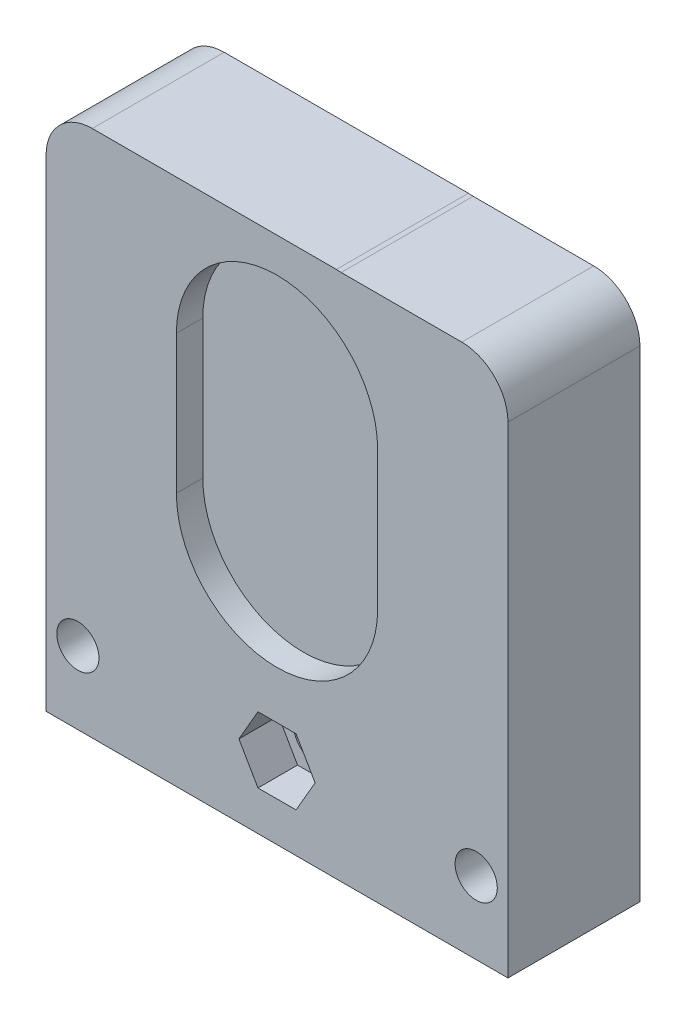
from build123d import *

# Parameters (mm, degrees)
BOSS_EXTRUDE1_DEPTH = 20
FILLET1_R           = 7
SKETCH2_R           = 3.2
SKETCH2_R_2         = 3.5
CUT_EXTRUDE1_DEPTH  = 109.166538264
CUT_EXTRUDE2_DEPTH  = 4
CUT_EXTRUDE3_DEPTH  = 6
FILLET2_R           = 7


with BuildPart() as part:
    # Sketch1 → Boss-Extrude1 (new body)
    with BuildSketch(Plane.XY):
        Polygon((26, 80), (44, 80), (44.724522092, 79.960438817), (70, 79.960438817), (70, 18), (70, 0), (0, 0), (0, 18), (0, 80), align=None)
    extrude(amount=BOSS_EXTRUDE1_DEPTH)

    # Fillet1
    fillet1_edges = [part.edges().sort_by_distance(p)[0] for p in [
        (0, 80, 10),
    ]]
    fillet(fillet1_edges, radius=FILLET1_R)

    # Sketch2 → Cut-Extrude1 (cut, through all)
    with BuildSketch(Plane.XY.offset(20)):
        with Locations((4.815, 11)):
            Circle(SKETCH2_R)
        with Locations((65.185, 11)):
            Circle(SKETCH2_R)
        with Locations((35, 11)):
            Circle(SKETCH2_R_2)
    extrude(amount=-CUT_EXTRUDE1_DEPTH, mode=Mode.SUBTRACT)

    # Sketch3 → Cut-Extrude2 (cut)
    with BuildSketch(Plane.XY.offset(20)):
        with BuildLine():
            Line((19.75, 59.5), (19.75, 38.5))
            ThreePointArc((19.75, 38.5), (35, 23.25), (50.25, 38.5))
            Line((50.25, 38.5), (50.25, 59.5))
            ThreePointArc((50.25, 59.5), (35, 74.75), (19.75, 59.5))
        make_face()
    extrude(amount=-CUT_EXTRUDE2_DEPTH, mode=Mode.SUBTRACT)

    # Sketch7 → Cut-Extrude3 (cut)
    with BuildSketch(Plane.XY.offset(20)):
        Polygon((40.773502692, 11), (37.886751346, 16), (32.113248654, 16), (29.226497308, 11), (32.113248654, 6), (37.886751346, 6), align=None)
    extrude(amount=-CUT_EXTRUDE3_DEPTH, mode=Mode.SUBTRACT)

    # Fillet2
    fillet2_edges = [part.edges().sort_by_distance(p)[0] for p in [
        (70, 79.960438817, 10),
    ]]
    fillet(fillet2_edges, radius=FILLET2_R)


solid = part.part
